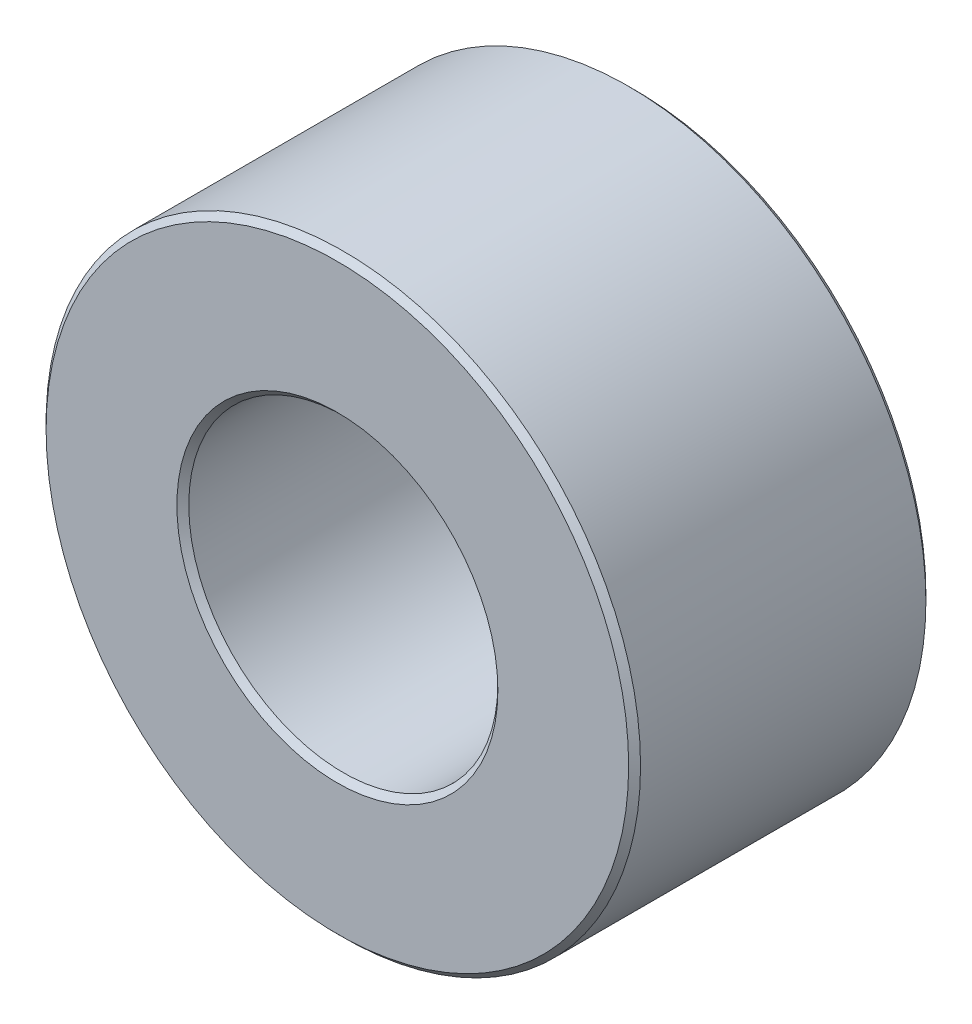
ISO-10303-21;
HEADER;
FILE_DESCRIPTION(('STEP AP214'),'2;1');
FILE_NAME('part.step','',(''),(''),'','','');
FILE_SCHEMA(('AUTOMOTIVE_DESIGN { 1 0 10303 214 1 1 1 1 }'));
ENDSEC;
DATA;
#1=APPLICATION_CONTEXT('core data for automotive mechanical design processes');
#2=APPLICATION_PROTOCOL_DEFINITION('international standard','automotive_design',2000,#1);
#3=PRODUCT_CONTEXT('',#1,'mechanical');
#4=PRODUCT('Part','Part','',(#3));
#5=PRODUCT_RELATED_PRODUCT_CATEGORY('part','',(#4));
#6=PRODUCT_DEFINITION_FORMATION('','',#4);
#7=PRODUCT_DEFINITION_CONTEXT('part definition',#1,'design');
#8=PRODUCT_DEFINITION('design','',#6,#7);
#9=PRODUCT_DEFINITION_SHAPE('','',#8);
#10=(LENGTH_UNIT() NAMED_UNIT(*) SI_UNIT(.MILLI.,.METRE.));
#11=(NAMED_UNIT(*) PLANE_ANGLE_UNIT() SI_UNIT($,.RADIAN.));
#12=(NAMED_UNIT(*) SI_UNIT($,.STERADIAN.) SOLID_ANGLE_UNIT());
#13=UNCERTAINTY_MEASURE_WITH_UNIT(LENGTH_MEASURE(1.E-05),#10,'distance_accuracy_value','');
#14=(GEOMETRIC_REPRESENTATION_CONTEXT(3) GLOBAL_UNCERTAINTY_ASSIGNED_CONTEXT((#13)) GLOBAL_UNIT_ASSIGNED_CONTEXT((#10,
#11,#12)) REPRESENTATION_CONTEXT('',''));
#15=CARTESIAN_POINT('',(0.,0.,0.));
#16=DIRECTION('',(0.,0.,1.));
#17=DIRECTION('',(1.,0.,0.));
#18=AXIS2_PLACEMENT_3D('',#15,#16,#17);
#19=CARTESIAN_POINT('',(0.,0.,2.5));
#20=DIRECTION('',(0.,0.,1.));
#21=DIRECTION('',(1.,0.,0.));
#22=AXIS2_PLACEMENT_3D('',#19,#20,#21);
#23=PLANE('',#22);
#24=CARTESIAN_POINT('',(0.,0.,2.5));
#25=DIRECTION('',(0.,0.,1.));
#26=DIRECTION('',(1.,0.,0.));
#27=AXIS2_PLACEMENT_3D('',#24,#25,#26);
#28=CIRCLE('',#27,2.7);
#29=CARTESIAN_POINT('',(2.7,0.,2.5));
#30=VERTEX_POINT('',#29);
#31=EDGE_CURVE('E10',#30,#30,#28,.F.);
#32=ORIENTED_EDGE('',*,*,#31,.T.);
#33=EDGE_LOOP('',(#32));
#34=FACE_BOUND('',#33,.T.);
#35=CARTESIAN_POINT('',(0.,0.,2.5));
#36=DIRECTION('',(0.,0.,1.));
#37=DIRECTION('',(1.,0.,0.));
#38=AXIS2_PLACEMENT_3D('',#35,#36,#37);
#39=CIRCLE('',#38,4.9);
#40=CARTESIAN_POINT('',(4.9,0.,2.5));
#41=VERTEX_POINT('',#40);
#42=EDGE_CURVE('E45',#41,#41,#39,.T.);
#43=ORIENTED_EDGE('',*,*,#42,.T.);
#44=EDGE_LOOP('',(#43));
#45=FACE_BOUND('',#44,.T.);
#46=ADVANCED_FACE('F37',(#34,#45),#23,.T.);
#47=CARTESIAN_POINT('',(0.,0.,-2.5));
#48=DIRECTION('',(0.,0.,1.));
#49=DIRECTION('',(1.,0.,0.));
#50=AXIS2_PLACEMENT_3D('',#47,#48,#49);
#51=PLANE('',#50);
#52=CARTESIAN_POINT('',(0.,0.,-2.5));
#53=DIRECTION('',(0.,0.,1.));
#54=DIRECTION('',(1.,0.,0.));
#55=AXIS2_PLACEMENT_3D('',#52,#53,#54);
#56=CIRCLE('',#55,4.9);
#57=CARTESIAN_POINT('',(4.9,0.,-2.5));
#58=VERTEX_POINT('',#57);
#59=EDGE_CURVE('E63',#58,#58,#56,.F.);
#60=ORIENTED_EDGE('',*,*,#59,.T.);
#61=EDGE_LOOP('',(#60));
#62=FACE_BOUND('',#61,.T.);
#63=CARTESIAN_POINT('',(0.,0.,-2.5));
#64=DIRECTION('',(0.,0.,1.));
#65=DIRECTION('',(1.,0.,0.));
#66=AXIS2_PLACEMENT_3D('',#63,#64,#65);
#67=CIRCLE('',#66,2.7);
#68=CARTESIAN_POINT('',(2.7,0.,-2.5));
#69=VERTEX_POINT('',#68);
#70=EDGE_CURVE('E67',#69,#69,#67,.T.);
#71=ORIENTED_EDGE('',*,*,#70,.T.);
#72=EDGE_LOOP('',(#71));
#73=FACE_BOUND('',#72,.T.);
#74=ADVANCED_FACE('F89',(#62,#73),#51,.F.);
#75=CARTESIAN_POINT('',(0.,0.,2.5));
#76=DIRECTION('',(0.,0.,-1.));
#77=DIRECTION('',(-1.,0.,0.));
#78=AXIS2_PLACEMENT_3D('',#75,#76,#77);
#79=CYLINDRICAL_SURFACE('',#78,5.);
#80=CARTESIAN_POINT('',(0.,0.,-2.4));
#81=DIRECTION('',(0.,0.,1.));
#82=DIRECTION('',(1.,0.,0.));
#83=AXIS2_PLACEMENT_3D('',#80,#81,#82);
#84=CIRCLE('',#83,5.);
#85=CARTESIAN_POINT('',(5.,0.,-2.4));
#86=VERTEX_POINT('',#85);
#87=EDGE_CURVE('E70',#86,#86,#84,.T.);
#88=ORIENTED_EDGE('',*,*,#87,.T.);
#89=EDGE_LOOP('',(#88));
#90=FACE_BOUND('',#89,.T.);
#91=CARTESIAN_POINT('',(0.,0.,2.4));
#92=DIRECTION('',(0.,0.,1.));
#93=DIRECTION('',(1.,0.,0.));
#94=AXIS2_PLACEMENT_3D('',#91,#92,#93);
#95=CIRCLE('',#94,5.);
#96=CARTESIAN_POINT('',(5.,0.,2.4));
#97=VERTEX_POINT('',#96);
#98=EDGE_CURVE('E73',#97,#97,#95,.F.);
#99=ORIENTED_EDGE('',*,*,#98,.T.);
#100=EDGE_LOOP('',(#99));
#101=FACE_BOUND('',#100,.T.);
#102=ADVANCED_FACE('F78',(#90,#101),#79,.T.);
#103=CARTESIAN_POINT('',(0.,0.,2.5));
#104=DIRECTION('',(0.,0.,-1.));
#105=DIRECTION('',(-1.,0.,0.));
#106=AXIS2_PLACEMENT_3D('',#103,#104,#105);
#107=CYLINDRICAL_SURFACE('',#106,2.6);
#108=CARTESIAN_POINT('',(0.,0.,-2.4));
#109=DIRECTION('',(0.,0.,1.));
#110=DIRECTION('',(1.,0.,0.));
#111=AXIS2_PLACEMENT_3D('',#108,#109,#110);
#112=CIRCLE('',#111,2.6);
#113=CARTESIAN_POINT('',(2.6,0.,-2.4));
#114=VERTEX_POINT('',#113);
#115=EDGE_CURVE('E52',#114,#114,#112,.F.);
#116=ORIENTED_EDGE('',*,*,#115,.T.);
#117=EDGE_LOOP('',(#116));
#118=FACE_BOUND('',#117,.T.);
#119=CARTESIAN_POINT('',(0.,0.,2.4));
#120=DIRECTION('',(0.,0.,1.));
#121=DIRECTION('',(1.,0.,0.));
#122=AXIS2_PLACEMENT_3D('',#119,#120,#121);
#123=CIRCLE('',#122,2.6);
#124=CARTESIAN_POINT('',(2.6,0.,2.4));
#125=VERTEX_POINT('',#124);
#126=EDGE_CURVE('E58',#125,#125,#123,.T.);
#127=ORIENTED_EDGE('',*,*,#126,.T.);
#128=EDGE_LOOP('',(#127));
#129=FACE_BOUND('',#128,.T.);
#130=ADVANCED_FACE('F97',(#118,#129),#107,.F.);
#131=CARTESIAN_POINT('',(0.,0.,-2.4));
#132=DIRECTION('',(0.,0.,1.));
#133=DIRECTION('',(1.,0.,0.));
#134=AXIS2_PLACEMENT_3D('',#131,#132,#133);
#135=CONICAL_SURFACE('',#134,5.,0.785398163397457);
#136=ORIENTED_EDGE('',*,*,#59,.F.);
#137=EDGE_LOOP('',(#136));
#138=FACE_BOUND('',#137,.T.);
#139=ORIENTED_EDGE('',*,*,#87,.F.);
#140=EDGE_LOOP('',(#139));
#141=FACE_BOUND('',#140,.T.);
#142=ADVANCED_FACE('F102',(#138,#141),#135,.T.);
#143=CARTESIAN_POINT('',(0.,0.,-2.5));
#144=DIRECTION('',(0.,0.,-1.));
#145=DIRECTION('',(-1.,0.,0.));
#146=AXIS2_PLACEMENT_3D('',#143,#144,#145);
#147=CONICAL_SURFACE('',#146,2.7,0.785398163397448);
#148=ORIENTED_EDGE('',*,*,#115,.F.);
#149=EDGE_LOOP('',(#148));
#150=FACE_BOUND('',#149,.T.);
#151=ORIENTED_EDGE('',*,*,#70,.F.);
#152=EDGE_LOOP('',(#151));
#153=FACE_BOUND('',#152,.T.);
#154=ADVANCED_FACE('F86',(#150,#153),#147,.F.);
#155=CARTESIAN_POINT('',(0.,0.,2.4));
#156=DIRECTION('',(0.,0.,1.));
#157=DIRECTION('',(1.,0.,0.));
#158=AXIS2_PLACEMENT_3D('',#155,#156,#157);
#159=CONICAL_SURFACE('',#158,2.6,0.785398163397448);
#160=ORIENTED_EDGE('',*,*,#31,.F.);
#161=EDGE_LOOP('',(#160));
#162=FACE_BOUND('',#161,.T.);
#163=ORIENTED_EDGE('',*,*,#126,.F.);
#164=EDGE_LOOP('',(#163));
#165=FACE_BOUND('',#164,.T.);
#166=ADVANCED_FACE('F82',(#162,#165),#159,.F.);
#167=CARTESIAN_POINT('',(0.,0.,2.5));
#168=DIRECTION('',(0.,0.,-1.));
#169=DIRECTION('',(-1.,0.,0.));
#170=AXIS2_PLACEMENT_3D('',#167,#168,#169);
#171=CONICAL_SURFACE('',#170,4.9,0.785398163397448);
#172=ORIENTED_EDGE('',*,*,#98,.F.);
#173=EDGE_LOOP('',(#172));
#174=FACE_BOUND('',#173,.T.);
#175=ORIENTED_EDGE('',*,*,#42,.F.);
#176=EDGE_LOOP('',(#175));
#177=FACE_BOUND('',#176,.T.);
#178=ADVANCED_FACE('F39',(#174,#177),#171,.T.);
#179=CLOSED_SHELL('',(#46,#74,#102,#130,#142,#154,#166,#178));
#180=MANIFOLD_SOLID_BREP('B2',#179);
#181=ADVANCED_BREP_SHAPE_REPRESENTATION('',(#18,#180),#14);
#182=SHAPE_DEFINITION_REPRESENTATION(#9,#181);
ENDSEC;
END-ISO-10303-21;
